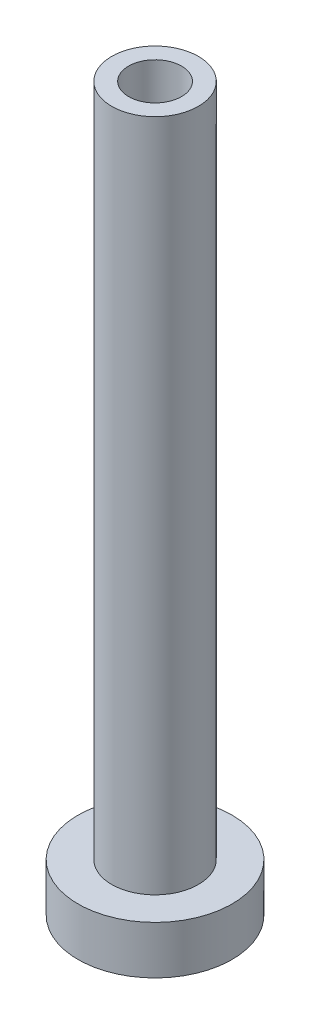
ISO-10303-21;
HEADER;
FILE_DESCRIPTION(('STEP AP214'),'2;1');
FILE_NAME('part.step','',(''),(''),'','','');
FILE_SCHEMA(('AUTOMOTIVE_DESIGN { 1 0 10303 214 1 1 1 1 }'));
ENDSEC;
DATA;
#1=APPLICATION_CONTEXT('core data for automotive mechanical design processes');
#2=APPLICATION_PROTOCOL_DEFINITION('international standard','automotive_design',2000,#1);
#3=PRODUCT_CONTEXT('',#1,'mechanical');
#4=PRODUCT('Part','Part','',(#3));
#5=PRODUCT_RELATED_PRODUCT_CATEGORY('part','',(#4));
#6=PRODUCT_DEFINITION_FORMATION('','',#4);
#7=PRODUCT_DEFINITION_CONTEXT('part definition',#1,'design');
#8=PRODUCT_DEFINITION('design','',#6,#7);
#9=PRODUCT_DEFINITION_SHAPE('','',#8);
#10=(LENGTH_UNIT() NAMED_UNIT(*) SI_UNIT(.MILLI.,.METRE.));
#11=(NAMED_UNIT(*) PLANE_ANGLE_UNIT() SI_UNIT($,.RADIAN.));
#12=(NAMED_UNIT(*) SI_UNIT($,.STERADIAN.) SOLID_ANGLE_UNIT());
#13=UNCERTAINTY_MEASURE_WITH_UNIT(LENGTH_MEASURE(1.E-05),#10,'distance_accuracy_value','');
#14=(GEOMETRIC_REPRESENTATION_CONTEXT(3) GLOBAL_UNCERTAINTY_ASSIGNED_CONTEXT((#13)) GLOBAL_UNIT_ASSIGNED_CONTEXT((#10,
#11,#12)) REPRESENTATION_CONTEXT('',''));
#15=CARTESIAN_POINT('',(0.,0.,0.));
#16=DIRECTION('',(0.,0.,1.));
#17=DIRECTION('',(1.,0.,0.));
#18=AXIS2_PLACEMENT_3D('',#15,#16,#17);
#19=CARTESIAN_POINT('',(0.,0.,0.));
#20=DIRECTION('',(0.,-1.,0.));
#21=DIRECTION('',(0.,0.,-1.));
#22=AXIS2_PLACEMENT_3D('',#19,#20,#21);
#23=CYLINDRICAL_SURFACE('',#22,8.);
#24=CARTESIAN_POINT('',(0.,-5.,0.));
#25=DIRECTION('',(0.,-1.,0.));
#26=DIRECTION('',(0.,0.,-1.));
#27=AXIS2_PLACEMENT_3D('',#24,#25,#26);
#28=CIRCLE('',#27,8.);
#29=CARTESIAN_POINT('',(0.,-5.,-8.));
#30=VERTEX_POINT('',#29);
#31=EDGE_CURVE('E42',#30,#30,#28,.T.);
#32=ORIENTED_EDGE('',*,*,#31,.F.);
#33=EDGE_LOOP('',(#32));
#34=FACE_BOUND('',#33,.T.);
#35=CARTESIAN_POINT('',(0.,0.,0.));
#36=DIRECTION('',(0.,-1.,0.));
#37=DIRECTION('',(0.,0.,-1.));
#38=AXIS2_PLACEMENT_3D('',#35,#36,#37);
#39=CIRCLE('',#38,8.);
#40=CARTESIAN_POINT('',(0.,0.,-8.));
#41=VERTEX_POINT('',#40);
#42=EDGE_CURVE('E9',#41,#41,#39,.T.);
#43=ORIENTED_EDGE('',*,*,#42,.T.);
#44=EDGE_LOOP('',(#43));
#45=FACE_BOUND('',#44,.T.);
#46=ADVANCED_FACE('F14',(#34,#45),#23,.T.);
#47=CARTESIAN_POINT('',(-8.,0.,0.));
#48=DIRECTION('',(0.,-1.,0.));
#49=DIRECTION('',(0.,0.,-1.));
#50=AXIS2_PLACEMENT_3D('',#47,#48,#49);
#51=PLANE('',#50);
#52=ORIENTED_EDGE('',*,*,#42,.F.);
#53=EDGE_LOOP('',(#52));
#54=FACE_BOUND('',#53,.T.);
#55=CARTESIAN_POINT('',(0.,0.,0.));
#56=DIRECTION('',(0.,-1.,0.));
#57=DIRECTION('',(0.,0.,-1.));
#58=AXIS2_PLACEMENT_3D('',#55,#56,#57);
#59=CIRCLE('',#58,4.5);
#60=CARTESIAN_POINT('',(0.,0.,-4.5));
#61=VERTEX_POINT('',#60);
#62=EDGE_CURVE('E20',#61,#61,#59,.T.);
#63=ORIENTED_EDGE('',*,*,#62,.T.);
#64=EDGE_LOOP('',(#63));
#65=FACE_BOUND('',#64,.T.);
#66=ADVANCED_FACE('F49',(#54,#65),#51,.F.);
#67=CARTESIAN_POINT('',(0.,0.,0.));
#68=DIRECTION('',(0.,-1.,0.));
#69=DIRECTION('',(0.,0.,-1.));
#70=AXIS2_PLACEMENT_3D('',#67,#68,#69);
#71=CYLINDRICAL_SURFACE('',#70,4.5);
#72=ORIENTED_EDGE('',*,*,#62,.F.);
#73=EDGE_LOOP('',(#72));
#74=FACE_BOUND('',#73,.T.);
#75=CARTESIAN_POINT('',(0.,70.,0.));
#76=DIRECTION('',(0.,-1.,0.));
#77=DIRECTION('',(0.,0.,-1.));
#78=AXIS2_PLACEMENT_3D('',#75,#76,#77);
#79=CIRCLE('',#78,4.5);
#80=CARTESIAN_POINT('',(0.,70.,-4.5));
#81=VERTEX_POINT('',#80);
#82=EDGE_CURVE('E24',#81,#81,#79,.T.);
#83=ORIENTED_EDGE('',*,*,#82,.T.);
#84=EDGE_LOOP('',(#83));
#85=FACE_BOUND('',#84,.T.);
#86=ADVANCED_FACE('F55',(#74,#85),#71,.T.);
#87=CARTESIAN_POINT('',(-4.5,70.,0.));
#88=DIRECTION('',(0.,-1.,0.));
#89=DIRECTION('',(0.,0.,-1.));
#90=AXIS2_PLACEMENT_3D('',#87,#88,#89);
#91=PLANE('',#90);
#92=ORIENTED_EDGE('',*,*,#82,.F.);
#93=EDGE_LOOP('',(#92));
#94=FACE_BOUND('',#93,.T.);
#95=CARTESIAN_POINT('',(0.,70.,0.));
#96=DIRECTION('',(0.,-1.,0.));
#97=DIRECTION('',(0.,0.,-1.));
#98=AXIS2_PLACEMENT_3D('',#95,#96,#97);
#99=CIRCLE('',#98,2.75);
#100=CARTESIAN_POINT('',(0.,70.,-2.75));
#101=VERTEX_POINT('',#100);
#102=EDGE_CURVE('E28',#101,#101,#99,.T.);
#103=ORIENTED_EDGE('',*,*,#102,.T.);
#104=EDGE_LOOP('',(#103));
#105=FACE_BOUND('',#104,.T.);
#106=ADVANCED_FACE('F61',(#94,#105),#91,.F.);
#107=CARTESIAN_POINT('',(0.,0.,0.));
#108=DIRECTION('',(0.,-1.,0.));
#109=DIRECTION('',(0.,0.,-1.));
#110=AXIS2_PLACEMENT_3D('',#107,#108,#109);
#111=CYLINDRICAL_SURFACE('',#110,2.75);
#112=ORIENTED_EDGE('',*,*,#102,.F.);
#113=EDGE_LOOP('',(#112));
#114=FACE_BOUND('',#113,.T.);
#115=CARTESIAN_POINT('',(0.,25.,0.));
#116=DIRECTION('',(0.,-1.,0.));
#117=DIRECTION('',(0.,0.,-1.));
#118=AXIS2_PLACEMENT_3D('',#115,#116,#117);
#119=CIRCLE('',#118,2.74999999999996);
#120=CARTESIAN_POINT('',(0.,25.,-2.74999999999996));
#121=VERTEX_POINT('',#120);
#122=EDGE_CURVE('E33',#121,#121,#119,.T.);
#123=ORIENTED_EDGE('',*,*,#122,.T.);
#124=EDGE_LOOP('',(#123));
#125=FACE_BOUND('',#124,.T.);
#126=ADVANCED_FACE('F67',(#114,#125),#111,.F.);
#127=CARTESIAN_POINT('',(0.,24.75,0.));
#128=DIRECTION('',(0.,-1.,0.));
#129=DIRECTION('',(0.,0.,-1.));
#130=AXIS2_PLACEMENT_3D('',#127,#128,#129);
#131=CONICAL_SURFACE('',#130,3.,0.785398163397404);
#132=ORIENTED_EDGE('',*,*,#122,.F.);
#133=EDGE_LOOP('',(#132));
#134=FACE_BOUND('',#133,.T.);
#135=CARTESIAN_POINT('',(0.,24.75,0.));
#136=DIRECTION('',(0.,-1.,0.));
#137=DIRECTION('',(0.,0.,-1.));
#138=AXIS2_PLACEMENT_3D('',#135,#136,#137);
#139=CIRCLE('',#138,3.);
#140=CARTESIAN_POINT('',(0.,24.75,-3.));
#141=VERTEX_POINT('',#140);
#142=EDGE_CURVE('E36',#141,#141,#139,.T.);
#143=ORIENTED_EDGE('',*,*,#142,.T.);
#144=EDGE_LOOP('',(#143));
#145=FACE_BOUND('',#144,.T.);
#146=ADVANCED_FACE('F71',(#134,#145),#131,.F.);
#147=CARTESIAN_POINT('',(0.,0.,0.));
#148=DIRECTION('',(0.,-1.,0.));
#149=DIRECTION('',(0.,0.,-1.));
#150=AXIS2_PLACEMENT_3D('',#147,#148,#149);
#151=CYLINDRICAL_SURFACE('',#150,3.);
#152=ORIENTED_EDGE('',*,*,#142,.F.);
#153=EDGE_LOOP('',(#152));
#154=FACE_BOUND('',#153,.T.);
#155=CARTESIAN_POINT('',(0.,-5.,0.));
#156=DIRECTION('',(0.,-1.,0.));
#157=DIRECTION('',(0.,0.,-1.));
#158=AXIS2_PLACEMENT_3D('',#155,#156,#157);
#159=CIRCLE('',#158,3.);
#160=CARTESIAN_POINT('',(0.,-5.,-3.));
#161=VERTEX_POINT('',#160);
#162=EDGE_CURVE('E39',#161,#161,#159,.T.);
#163=ORIENTED_EDGE('',*,*,#162,.T.);
#164=EDGE_LOOP('',(#163));
#165=FACE_BOUND('',#164,.T.);
#166=ADVANCED_FACE('F75',(#154,#165),#151,.F.);
#167=CARTESIAN_POINT('',(-3.,-5.,0.));
#168=DIRECTION('',(0.,1.,0.));
#169=DIRECTION('',(0.,0.,1.));
#170=AXIS2_PLACEMENT_3D('',#167,#168,#169);
#171=PLANE('',#170);
#172=ORIENTED_EDGE('',*,*,#162,.F.);
#173=EDGE_LOOP('',(#172));
#174=FACE_BOUND('',#173,.T.);
#175=ORIENTED_EDGE('',*,*,#31,.T.);
#176=EDGE_LOOP('',(#175));
#177=FACE_BOUND('',#176,.T.);
#178=ADVANCED_FACE('F46',(#174,#177),#171,.F.);
#179=CLOSED_SHELL('',(#46,#66,#86,#106,#126,#146,#166,#178));
#180=MANIFOLD_SOLID_BREP('B1',#179);
#181=ADVANCED_BREP_SHAPE_REPRESENTATION('',(#18,#180),#14);
#182=SHAPE_DEFINITION_REPRESENTATION(#9,#181);
ENDSEC;
END-ISO-10303-21;
